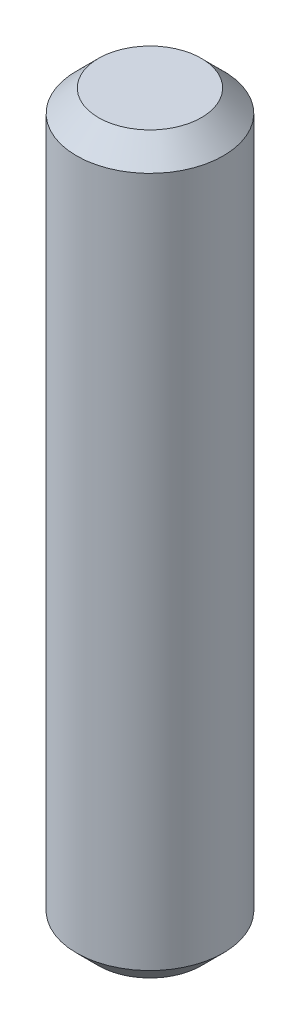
from build123d import *

# Parameters (mm, degrees)
SKETCH_1_R      = 1
EXTRUDE_1_DEPTH = 10
CHAMFER_1_SIZE  = 0.3


with BuildPart() as part:
    # Sketch 1 → Extrude 1 (new body)
    with BuildSketch(Plane(origin=(0, 0, 0), x_dir=(1, 0, 0), z_dir=(0, 1, 0))):
        with Locations(Location((0, 0, 0), (0, 0, 270))):
            Circle(SKETCH_1_R)
    extrude(amount=EXTRUDE_1_DEPTH)

    # Chamfer 1
    chamfer_1_edges = [part.edges().sort_by_distance(p)[0] for p in [
        (0, 0, -1),
        (0, 10, -1),
    ]]
    chamfer(chamfer_1_edges, length=CHAMFER_1_SIZE)


solid = part.part
